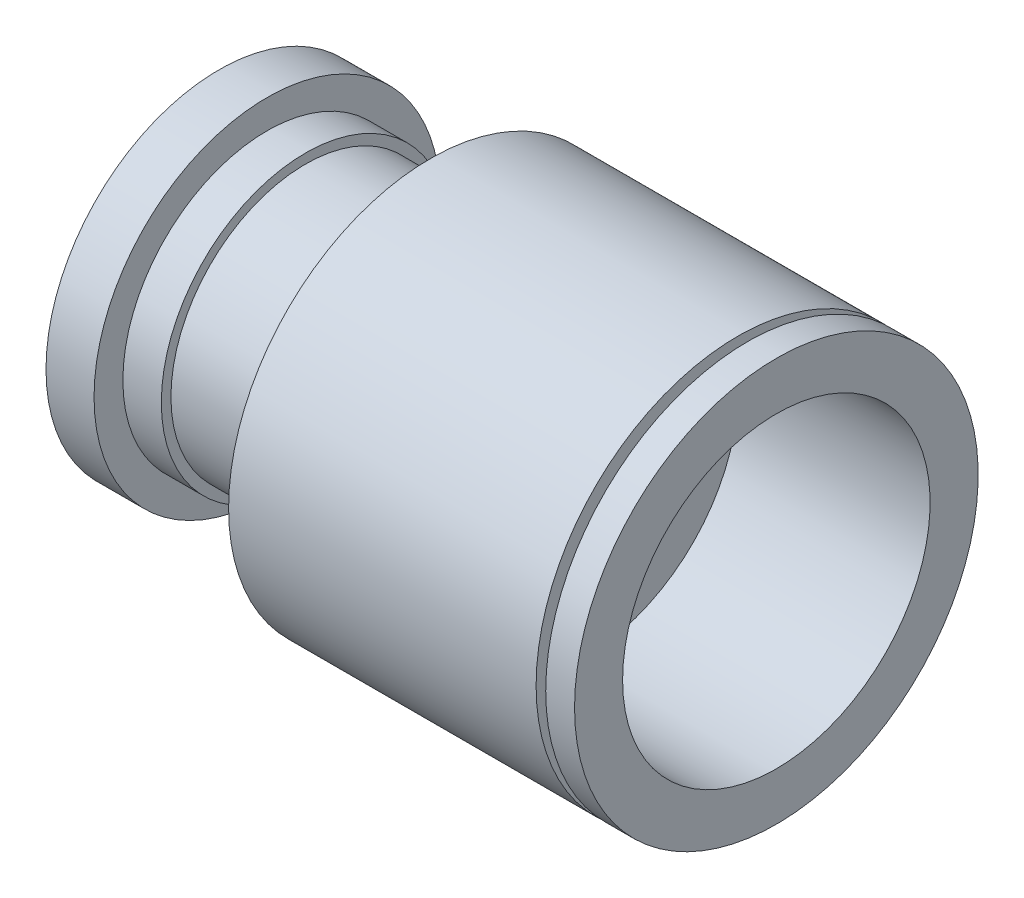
ISO-10303-21;
HEADER;
FILE_DESCRIPTION(('STEP AP214'),'2;1');
FILE_NAME('part.step','',(''),(''),'','','');
FILE_SCHEMA(('AUTOMOTIVE_DESIGN { 1 0 10303 214 1 1 1 1 }'));
ENDSEC;
DATA;
#1=APPLICATION_CONTEXT('core data for automotive mechanical design processes');
#2=APPLICATION_PROTOCOL_DEFINITION('international standard','automotive_design',2000,#1);
#3=PRODUCT_CONTEXT('',#1,'mechanical');
#4=PRODUCT('Part','Part','',(#3));
#5=PRODUCT_RELATED_PRODUCT_CATEGORY('part','',(#4));
#6=PRODUCT_DEFINITION_FORMATION('','',#4);
#7=PRODUCT_DEFINITION_CONTEXT('part definition',#1,'design');
#8=PRODUCT_DEFINITION('design','',#6,#7);
#9=PRODUCT_DEFINITION_SHAPE('','',#8);
#10=(LENGTH_UNIT() NAMED_UNIT(*) SI_UNIT(.MILLI.,.METRE.));
#11=(NAMED_UNIT(*) PLANE_ANGLE_UNIT() SI_UNIT($,.RADIAN.));
#12=(NAMED_UNIT(*) SI_UNIT($,.STERADIAN.) SOLID_ANGLE_UNIT());
#13=UNCERTAINTY_MEASURE_WITH_UNIT(LENGTH_MEASURE(1.E-05),#10,'distance_accuracy_value','');
#14=(GEOMETRIC_REPRESENTATION_CONTEXT(3) GLOBAL_UNCERTAINTY_ASSIGNED_CONTEXT((#13)) GLOBAL_UNIT_ASSIGNED_CONTEXT((#10,
#11,#12)) REPRESENTATION_CONTEXT('',''));
#15=CARTESIAN_POINT('',(0.,0.,0.));
#16=DIRECTION('',(0.,0.,1.));
#17=DIRECTION('',(1.,0.,0.));
#18=AXIS2_PLACEMENT_3D('',#15,#16,#17);
#19=CARTESIAN_POINT('',(0.,18.,0.));
#20=DIRECTION('',(1.,0.,0.));
#21=DIRECTION('',(0.,0.,-1.));
#22=AXIS2_PLACEMENT_3D('',#19,#20,#21);
#23=PLANE('',#22);
#24=CARTESIAN_POINT('',(0.,0.,0.));
#25=DIRECTION('',(-1.,0.,0.));
#26=DIRECTION('',(0.,0.,1.));
#27=AXIS2_PLACEMENT_3D('',#24,#25,#26);
#28=CIRCLE('',#27,11.);
#29=CARTESIAN_POINT('',(0.,0.,11.));
#30=VERTEX_POINT('',#29);
#31=EDGE_CURVE('E406',#30,#30,#28,.T.);
#32=ORIENTED_EDGE('',*,*,#31,.F.);
#33=EDGE_LOOP('',(#32));
#34=FACE_BOUND('',#33,.T.);
#35=CARTESIAN_POINT('',(0.,0.,0.));
#36=DIRECTION('',(-1.,0.,0.));
#37=DIRECTION('',(0.,0.,1.));
#38=AXIS2_PLACEMENT_3D('',#35,#36,#37);
#39=CIRCLE('',#38,18.);
#40=CARTESIAN_POINT('',(0.,0.,18.));
#41=VERTEX_POINT('',#40);
#42=EDGE_CURVE('E10',#41,#41,#39,.T.);
#43=ORIENTED_EDGE('',*,*,#42,.T.);
#44=EDGE_LOOP('',(#43));
#45=FACE_BOUND('',#44,.T.);
#46=ADVANCED_FACE('F348',(#34,#45),#23,.F.);
#47=CARTESIAN_POINT('',(0.,0.,0.));
#48=DIRECTION('',(-1.,0.,0.));
#49=DIRECTION('',(0.,0.,1.));
#50=AXIS2_PLACEMENT_3D('',#47,#48,#49);
#51=CYLINDRICAL_SURFACE('',#50,18.);
#52=ORIENTED_EDGE('',*,*,#42,.F.);
#53=EDGE_LOOP('',(#52));
#54=FACE_BOUND('',#53,.T.);
#55=CARTESIAN_POINT('',(5.,0.,0.));
#56=DIRECTION('',(-1.,0.,0.));
#57=DIRECTION('',(0.,0.,1.));
#58=AXIS2_PLACEMENT_3D('',#55,#56,#57);
#59=CIRCLE('',#58,18.);
#60=CARTESIAN_POINT('',(5.,0.,18.));
#61=VERTEX_POINT('',#60);
#62=EDGE_CURVE('E354',#61,#61,#59,.T.);
#63=ORIENTED_EDGE('',*,*,#62,.T.);
#64=EDGE_LOOP('',(#63));
#65=FACE_BOUND('',#64,.T.);
#66=ADVANCED_FACE('F413',(#54,#65),#51,.T.);
#67=CARTESIAN_POINT('',(5.,15.,0.));
#68=DIRECTION('',(-1.,0.,0.));
#69=DIRECTION('',(0.,0.,1.));
#70=AXIS2_PLACEMENT_3D('',#67,#68,#69);
#71=PLANE('',#70);
#72=ORIENTED_EDGE('',*,*,#62,.F.);
#73=EDGE_LOOP('',(#72));
#74=FACE_BOUND('',#73,.T.);
#75=CARTESIAN_POINT('',(5.,0.,0.));
#76=DIRECTION('',(-1.,0.,0.));
#77=DIRECTION('',(0.,0.,1.));
#78=AXIS2_PLACEMENT_3D('',#75,#76,#77);
#79=CIRCLE('',#78,15.);
#80=CARTESIAN_POINT('',(5.,0.,15.));
#81=VERTEX_POINT('',#80);
#82=EDGE_CURVE('E358',#81,#81,#79,.T.);
#83=ORIENTED_EDGE('',*,*,#82,.T.);
#84=EDGE_LOOP('',(#83));
#85=FACE_BOUND('',#84,.T.);
#86=ADVANCED_FACE('F417',(#74,#85),#71,.F.);
#87=CARTESIAN_POINT('',(0.,0.,0.));
#88=DIRECTION('',(-1.,0.,0.));
#89=DIRECTION('',(0.,0.,1.));
#90=AXIS2_PLACEMENT_3D('',#87,#88,#89);
#91=CYLINDRICAL_SURFACE('',#90,15.);
#92=ORIENTED_EDGE('',*,*,#82,.F.);
#93=EDGE_LOOP('',(#92));
#94=FACE_BOUND('',#93,.T.);
#95=CARTESIAN_POINT('',(9.,0.,0.));
#96=DIRECTION('',(-1.,0.,0.));
#97=DIRECTION('',(0.,0.,1.));
#98=AXIS2_PLACEMENT_3D('',#95,#96,#97);
#99=CIRCLE('',#98,15.);
#100=CARTESIAN_POINT('',(9.,0.,15.));
#101=VERTEX_POINT('',#100);
#102=EDGE_CURVE('E362',#101,#101,#99,.T.);
#103=ORIENTED_EDGE('',*,*,#102,.T.);
#104=EDGE_LOOP('',(#103));
#105=FACE_BOUND('',#104,.T.);
#106=ADVANCED_FACE('F422',(#94,#105),#91,.T.);
#107=CARTESIAN_POINT('',(9.,14.,0.));
#108=DIRECTION('',(-1.,0.,0.));
#109=DIRECTION('',(0.,0.,1.));
#110=AXIS2_PLACEMENT_3D('',#107,#108,#109);
#111=PLANE('',#110);
#112=ORIENTED_EDGE('',*,*,#102,.F.);
#113=EDGE_LOOP('',(#112));
#114=FACE_BOUND('',#113,.T.);
#115=CARTESIAN_POINT('',(9.,0.,0.));
#116=DIRECTION('',(-1.,0.,0.));
#117=DIRECTION('',(0.,0.,1.));
#118=AXIS2_PLACEMENT_3D('',#115,#116,#117);
#119=CIRCLE('',#118,14.);
#120=CARTESIAN_POINT('',(9.,0.,14.));
#121=VERTEX_POINT('',#120);
#122=EDGE_CURVE('E367',#121,#121,#119,.T.);
#123=ORIENTED_EDGE('',*,*,#122,.T.);
#124=EDGE_LOOP('',(#123));
#125=FACE_BOUND('',#124,.T.);
#126=ADVANCED_FACE('F428',(#114,#125),#111,.F.);
#127=CARTESIAN_POINT('',(0.,0.,0.));
#128=DIRECTION('',(-1.,0.,0.));
#129=DIRECTION('',(0.,0.,1.));
#130=AXIS2_PLACEMENT_3D('',#127,#128,#129);
#131=CYLINDRICAL_SURFACE('',#130,14.);
#132=ORIENTED_EDGE('',*,*,#122,.F.);
#133=EDGE_LOOP('',(#132));
#134=FACE_BOUND('',#133,.T.);
#135=CARTESIAN_POINT('',(18.,0.,0.));
#136=DIRECTION('',(-1.,0.,0.));
#137=DIRECTION('',(0.,0.,1.));
#138=AXIS2_PLACEMENT_3D('',#135,#136,#137);
#139=CIRCLE('',#138,14.);
#140=CARTESIAN_POINT('',(18.,0.,14.));
#141=VERTEX_POINT('',#140);
#142=EDGE_CURVE('E370',#141,#141,#139,.T.);
#143=ORIENTED_EDGE('',*,*,#142,.T.);
#144=EDGE_LOOP('',(#143));
#145=FACE_BOUND('',#144,.T.);
#146=ADVANCED_FACE('F432',(#134,#145),#131,.T.);
#147=CARTESIAN_POINT('',(18.,15.,0.));
#148=DIRECTION('',(1.,0.,0.));
#149=DIRECTION('',(0.,0.,-1.));
#150=AXIS2_PLACEMENT_3D('',#147,#148,#149);
#151=PLANE('',#150);
#152=ORIENTED_EDGE('',*,*,#142,.F.);
#153=EDGE_LOOP('',(#152));
#154=FACE_BOUND('',#153,.T.);
#155=CARTESIAN_POINT('',(18.,0.,0.));
#156=DIRECTION('',(-1.,0.,0.));
#157=DIRECTION('',(0.,0.,1.));
#158=AXIS2_PLACEMENT_3D('',#155,#156,#157);
#159=CIRCLE('',#158,15.);
#160=CARTESIAN_POINT('',(18.,0.,15.));
#161=VERTEX_POINT('',#160);
#162=EDGE_CURVE('E373',#161,#161,#159,.T.);
#163=ORIENTED_EDGE('',*,*,#162,.T.);
#164=EDGE_LOOP('',(#163));
#165=FACE_BOUND('',#164,.T.);
#166=ADVANCED_FACE('F436',(#154,#165),#151,.F.);
#167=CARTESIAN_POINT('',(0.,0.,0.));
#168=DIRECTION('',(-1.,0.,0.));
#169=DIRECTION('',(0.,0.,1.));
#170=AXIS2_PLACEMENT_3D('',#167,#168,#169);
#171=CYLINDRICAL_SURFACE('',#170,15.);
#172=ORIENTED_EDGE('',*,*,#162,.F.);
#173=EDGE_LOOP('',(#172));
#174=FACE_BOUND('',#173,.T.);
#175=CARTESIAN_POINT('',(22.,0.,0.));
#176=DIRECTION('',(-1.,0.,0.));
#177=DIRECTION('',(0.,0.,1.));
#178=AXIS2_PLACEMENT_3D('',#175,#176,#177);
#179=CIRCLE('',#178,15.);
#180=CARTESIAN_POINT('',(22.,0.,15.));
#181=VERTEX_POINT('',#180);
#182=EDGE_CURVE('E376',#181,#181,#179,.T.);
#183=ORIENTED_EDGE('',*,*,#182,.T.);
#184=EDGE_LOOP('',(#183));
#185=FACE_BOUND('',#184,.T.);
#186=ADVANCED_FACE('F440',(#174,#185),#171,.T.);
#187=CARTESIAN_POINT('',(22.,21.,0.));
#188=DIRECTION('',(1.,0.,0.));
#189=DIRECTION('',(0.,0.,-1.));
#190=AXIS2_PLACEMENT_3D('',#187,#188,#189);
#191=PLANE('',#190);
#192=ORIENTED_EDGE('',*,*,#182,.F.);
#193=EDGE_LOOP('',(#192));
#194=FACE_BOUND('',#193,.T.);
#195=CARTESIAN_POINT('',(22.,0.,0.));
#196=DIRECTION('',(-1.,0.,0.));
#197=DIRECTION('',(0.,0.,1.));
#198=AXIS2_PLACEMENT_3D('',#195,#196,#197);
#199=CIRCLE('',#198,21.);
#200=CARTESIAN_POINT('',(22.,0.,21.));
#201=VERTEX_POINT('',#200);
#202=EDGE_CURVE('E379',#201,#201,#199,.T.);
#203=ORIENTED_EDGE('',*,*,#202,.T.);
#204=EDGE_LOOP('',(#203));
#205=FACE_BOUND('',#204,.T.);
#206=ADVANCED_FACE('F444',(#194,#205),#191,.F.);
#207=CARTESIAN_POINT('',(0.,0.,0.));
#208=DIRECTION('',(-1.,0.,0.));
#209=DIRECTION('',(0.,0.,1.));
#210=AXIS2_PLACEMENT_3D('',#207,#208,#209);
#211=CYLINDRICAL_SURFACE('',#210,21.);
#212=ORIENTED_EDGE('',*,*,#202,.F.);
#213=EDGE_LOOP('',(#212));
#214=FACE_BOUND('',#213,.T.);
#215=CARTESIAN_POINT('',(54.,0.,0.));
#216=DIRECTION('',(-1.,0.,0.));
#217=DIRECTION('',(0.,0.,1.));
#218=AXIS2_PLACEMENT_3D('',#215,#216,#217);
#219=CIRCLE('',#218,21.);
#220=CARTESIAN_POINT('',(54.,0.,21.));
#221=VERTEX_POINT('',#220);
#222=EDGE_CURVE('E382',#221,#221,#219,.T.);
#223=ORIENTED_EDGE('',*,*,#222,.T.);
#224=EDGE_LOOP('',(#223));
#225=FACE_BOUND('',#224,.T.);
#226=ADVANCED_FACE('F448',(#214,#225),#211,.T.);
#227=CARTESIAN_POINT('',(54.,19.,0.));
#228=DIRECTION('',(-1.,0.,0.));
#229=DIRECTION('',(0.,0.,1.));
#230=AXIS2_PLACEMENT_3D('',#227,#228,#229);
#231=PLANE('',#230);
#232=ORIENTED_EDGE('',*,*,#222,.F.);
#233=EDGE_LOOP('',(#232));
#234=FACE_BOUND('',#233,.T.);
#235=CARTESIAN_POINT('',(54.,0.,0.));
#236=DIRECTION('',(-1.,0.,0.));
#237=DIRECTION('',(0.,0.,1.));
#238=AXIS2_PLACEMENT_3D('',#235,#236,#237);
#239=CIRCLE('',#238,19.);
#240=CARTESIAN_POINT('',(54.,0.,19.));
#241=VERTEX_POINT('',#240);
#242=EDGE_CURVE('E385',#241,#241,#239,.T.);
#243=ORIENTED_EDGE('',*,*,#242,.T.);
#244=EDGE_LOOP('',(#243));
#245=FACE_BOUND('',#244,.T.);
#246=ADVANCED_FACE('F452',(#234,#245),#231,.F.);
#247=CARTESIAN_POINT('',(0.,0.,0.));
#248=DIRECTION('',(-1.,0.,0.));
#249=DIRECTION('',(0.,0.,1.));
#250=AXIS2_PLACEMENT_3D('',#247,#248,#249);
#251=CYLINDRICAL_SURFACE('',#250,19.);
#252=ORIENTED_EDGE('',*,*,#242,.F.);
#253=EDGE_LOOP('',(#252));
#254=FACE_BOUND('',#253,.T.);
#255=CARTESIAN_POINT('',(55.,0.,0.));
#256=DIRECTION('',(-1.,0.,0.));
#257=DIRECTION('',(0.,0.,1.));
#258=AXIS2_PLACEMENT_3D('',#255,#256,#257);
#259=CIRCLE('',#258,19.);
#260=CARTESIAN_POINT('',(55.,0.,19.));
#261=VERTEX_POINT('',#260);
#262=EDGE_CURVE('E388',#261,#261,#259,.T.);
#263=ORIENTED_EDGE('',*,*,#262,.T.);
#264=EDGE_LOOP('',(#263));
#265=FACE_BOUND('',#264,.T.);
#266=ADVANCED_FACE('F456',(#254,#265),#251,.T.);
#267=CARTESIAN_POINT('',(55.,21.,0.));
#268=DIRECTION('',(1.,0.,0.));
#269=DIRECTION('',(0.,0.,-1.));
#270=AXIS2_PLACEMENT_3D('',#267,#268,#269);
#271=PLANE('',#270);
#272=ORIENTED_EDGE('',*,*,#262,.F.);
#273=EDGE_LOOP('',(#272));
#274=FACE_BOUND('',#273,.T.);
#275=CARTESIAN_POINT('',(55.,0.,0.));
#276=DIRECTION('',(-1.,0.,0.));
#277=DIRECTION('',(0.,0.,1.));
#278=AXIS2_PLACEMENT_3D('',#275,#276,#277);
#279=CIRCLE('',#278,21.);
#280=CARTESIAN_POINT('',(55.,0.,21.));
#281=VERTEX_POINT('',#280);
#282=EDGE_CURVE('E391',#281,#281,#279,.T.);
#283=ORIENTED_EDGE('',*,*,#282,.T.);
#284=EDGE_LOOP('',(#283));
#285=FACE_BOUND('',#284,.T.);
#286=ADVANCED_FACE('F460',(#274,#285),#271,.F.);
#287=CARTESIAN_POINT('',(0.,0.,0.));
#288=DIRECTION('',(-1.,0.,0.));
#289=DIRECTION('',(0.,0.,1.));
#290=AXIS2_PLACEMENT_3D('',#287,#288,#289);
#291=CYLINDRICAL_SURFACE('',#290,21.);
#292=ORIENTED_EDGE('',*,*,#282,.F.);
#293=EDGE_LOOP('',(#292));
#294=FACE_BOUND('',#293,.T.);
#295=CARTESIAN_POINT('',(58.,0.,0.));
#296=DIRECTION('',(-1.,0.,0.));
#297=DIRECTION('',(0.,0.,1.));
#298=AXIS2_PLACEMENT_3D('',#295,#296,#297);
#299=CIRCLE('',#298,21.);
#300=CARTESIAN_POINT('',(58.,0.,21.));
#301=VERTEX_POINT('',#300);
#302=EDGE_CURVE('E394',#301,#301,#299,.T.);
#303=ORIENTED_EDGE('',*,*,#302,.T.);
#304=EDGE_LOOP('',(#303));
#305=FACE_BOUND('',#304,.T.);
#306=ADVANCED_FACE('F464',(#294,#305),#291,.T.);
#307=CARTESIAN_POINT('',(58.,16.,0.));
#308=DIRECTION('',(-1.,0.,0.));
#309=DIRECTION('',(0.,0.,1.));
#310=AXIS2_PLACEMENT_3D('',#307,#308,#309);
#311=PLANE('',#310);
#312=ORIENTED_EDGE('',*,*,#302,.F.);
#313=EDGE_LOOP('',(#312));
#314=FACE_BOUND('',#313,.T.);
#315=CARTESIAN_POINT('',(58.,0.,0.));
#316=DIRECTION('',(-1.,0.,0.));
#317=DIRECTION('',(0.,0.,1.));
#318=AXIS2_PLACEMENT_3D('',#315,#316,#317);
#319=CIRCLE('',#318,16.);
#320=CARTESIAN_POINT('',(58.,0.,16.));
#321=VERTEX_POINT('',#320);
#322=EDGE_CURVE('E397',#321,#321,#319,.T.);
#323=ORIENTED_EDGE('',*,*,#322,.T.);
#324=EDGE_LOOP('',(#323));
#325=FACE_BOUND('',#324,.T.);
#326=ADVANCED_FACE('F468',(#314,#325),#311,.F.);
#327=CARTESIAN_POINT('',(0.,0.,0.));
#328=DIRECTION('',(-1.,0.,0.));
#329=DIRECTION('',(0.,0.,1.));
#330=AXIS2_PLACEMENT_3D('',#327,#328,#329);
#331=CYLINDRICAL_SURFACE('',#330,16.);
#332=ORIENTED_EDGE('',*,*,#322,.F.);
#333=EDGE_LOOP('',(#332));
#334=FACE_BOUND('',#333,.T.);
#335=CARTESIAN_POINT('',(38.,0.,0.));
#336=DIRECTION('',(-1.,0.,0.));
#337=DIRECTION('',(0.,0.,1.));
#338=AXIS2_PLACEMENT_3D('',#335,#336,#337);
#339=CIRCLE('',#338,16.);
#340=CARTESIAN_POINT('',(38.,0.,16.));
#341=VERTEX_POINT('',#340);
#342=EDGE_CURVE('E400',#341,#341,#339,.T.);
#343=ORIENTED_EDGE('',*,*,#342,.T.);
#344=EDGE_LOOP('',(#343));
#345=FACE_BOUND('',#344,.T.);
#346=ADVANCED_FACE('F472',(#334,#345),#331,.F.);
#347=CARTESIAN_POINT('',(38.,11.,0.));
#348=DIRECTION('',(-1.,0.,0.));
#349=DIRECTION('',(0.,0.,1.));
#350=AXIS2_PLACEMENT_3D('',#347,#348,#349);
#351=PLANE('',#350);
#352=ORIENTED_EDGE('',*,*,#342,.F.);
#353=EDGE_LOOP('',(#352));
#354=FACE_BOUND('',#353,.T.);
#355=CARTESIAN_POINT('',(38.,0.,0.));
#356=DIRECTION('',(-1.,0.,0.));
#357=DIRECTION('',(0.,0.,1.));
#358=AXIS2_PLACEMENT_3D('',#355,#356,#357);
#359=CIRCLE('',#358,11.);
#360=CARTESIAN_POINT('',(38.,0.,11.));
#361=VERTEX_POINT('',#360);
#362=EDGE_CURVE('E403',#361,#361,#359,.T.);
#363=ORIENTED_EDGE('',*,*,#362,.T.);
#364=EDGE_LOOP('',(#363));
#365=FACE_BOUND('',#364,.T.);
#366=ADVANCED_FACE('F476',(#354,#365),#351,.F.);
#367=CARTESIAN_POINT('',(0.,0.,0.));
#368=DIRECTION('',(-1.,0.,0.));
#369=DIRECTION('',(0.,0.,1.));
#370=AXIS2_PLACEMENT_3D('',#367,#368,#369);
#371=CYLINDRICAL_SURFACE('',#370,11.);
#372=ORIENTED_EDGE('',*,*,#362,.F.);
#373=EDGE_LOOP('',(#372));
#374=FACE_BOUND('',#373,.T.);
#375=ORIENTED_EDGE('',*,*,#31,.T.);
#376=EDGE_LOOP('',(#375));
#377=FACE_BOUND('',#376,.T.);
#378=ADVANCED_FACE('F410',(#374,#377),#371,.F.);
#379=CLOSED_SHELL('',(#46,#66,#86,#106,#126,#146,#166,#186,#206,#226,#246,#266,#286,#306,#326,
#346,#366,#378));
#380=MANIFOLD_SOLID_BREP('B2',#379);
#381=ADVANCED_BREP_SHAPE_REPRESENTATION('',(#18,#380),#14);
#382=SHAPE_DEFINITION_REPRESENTATION(#9,#381);
ENDSEC;
END-ISO-10303-21;
